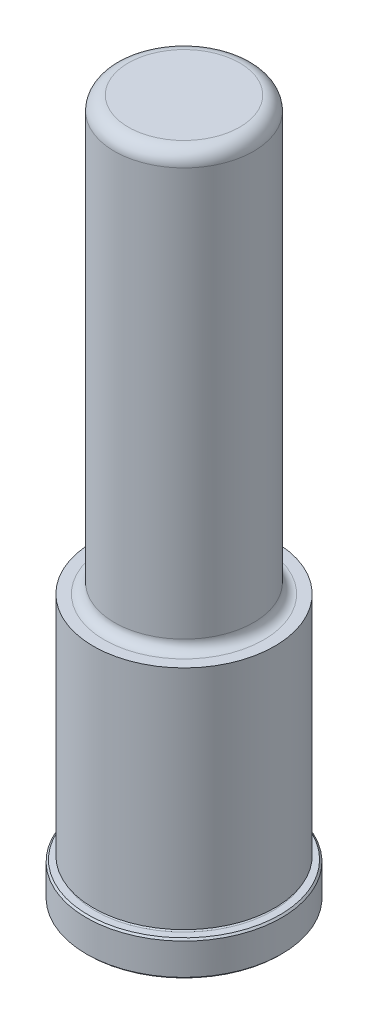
from build123d import *

# Parameters (mm, degrees)
CHAMFER1_SIZE = 0.381
FILLET7_R     = 3.175


with BuildPart() as part:
    # Sketch1 → Revolve1 (revolve)
    with BuildSketch(Plane(origin=(0, 0, 0), x_dir=(0, 0, -1), z_dir=(1, 0, 0)), mode=Mode.PRIVATE) as revolve1_sk:
        with BuildLine():
            Line((0, 0), (22.225, 0))
            Line((22.225, 0), (22.225, 7.9248))
            Line((22.225, 7.9248), (20.2438, 7.9248))
            ThreePointArc((20.2438, 7.9248), (19.8628, 8.3058), (20.2438, 8.6868))
            Line((20.2438, 8.6868), (20.6502, 8.6868))
            Line((20.6502, 8.6868), (20.6502, 60.325))
            Line((20.6502, 60.325), (18.1483, 60.325))
            ThreePointArc((18.1483, 60.325), (16.531853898, 60.994553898), (15.8623, 62.611))
            Line((15.8623, 62.611), (15.8623, 158.75))
            Line((15.8623, 158.75), (0, 158.75))
            Line((0, 158.75), (0, 0))
        make_face()
    revolve(revolve1_sk.sketch.rotate(Axis((0, 0, 0), (0, -1, 0)), 180), axis=Axis((0, 0, 0), (0, -1, 0)))

    # Chamfer1
    chamfer1_edges = [part.edges().sort_by_distance(p)[0] for p in [
        (0, 7.9248, -22.225),
        (0, 0, -22.225),
    ]]
    chamfer(chamfer1_edges, length=CHAMFER1_SIZE)

    # Fillet7
    fillet7_edges = [part.edges().sort_by_distance(p)[0] for p in [
        (0, 158.75, -15.8623),
    ]]
    fillet(fillet7_edges, radius=FILLET7_R)


solid = part.part
